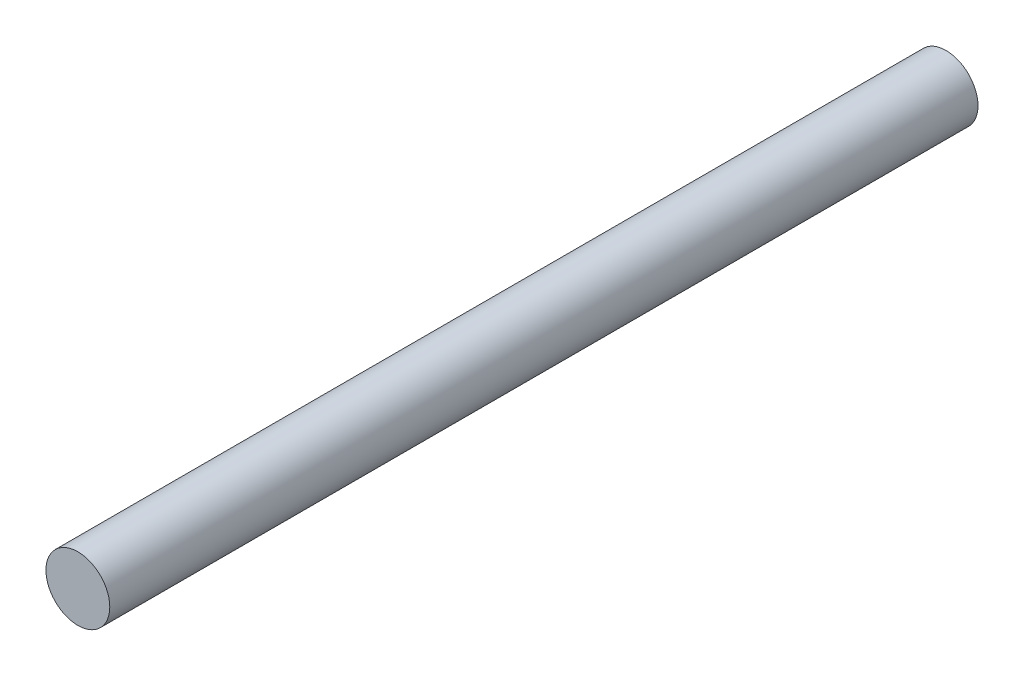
ISO-10303-21;
HEADER;
FILE_DESCRIPTION(('STEP AP214'),'2;1');
FILE_NAME('part.step','',(''),(''),'','','');
FILE_SCHEMA(('AUTOMOTIVE_DESIGN { 1 0 10303 214 1 1 1 1 }'));
ENDSEC;
DATA;
#1=APPLICATION_CONTEXT('core data for automotive mechanical design processes');
#2=APPLICATION_PROTOCOL_DEFINITION('international standard','automotive_design',2000,#1);
#3=PRODUCT_CONTEXT('',#1,'mechanical');
#4=PRODUCT('Part','Part','',(#3));
#5=PRODUCT_RELATED_PRODUCT_CATEGORY('part','',(#4));
#6=PRODUCT_DEFINITION_FORMATION('','',#4);
#7=PRODUCT_DEFINITION_CONTEXT('part definition',#1,'design');
#8=PRODUCT_DEFINITION('design','',#6,#7);
#9=PRODUCT_DEFINITION_SHAPE('','',#8);
#10=(LENGTH_UNIT() NAMED_UNIT(*) SI_UNIT(.MILLI.,.METRE.));
#11=(NAMED_UNIT(*) PLANE_ANGLE_UNIT() SI_UNIT($,.RADIAN.));
#12=(NAMED_UNIT(*) SI_UNIT($,.STERADIAN.) SOLID_ANGLE_UNIT());
#13=UNCERTAINTY_MEASURE_WITH_UNIT(LENGTH_MEASURE(1.E-05),#10,'distance_accuracy_value','');
#14=(GEOMETRIC_REPRESENTATION_CONTEXT(3) GLOBAL_UNCERTAINTY_ASSIGNED_CONTEXT((#13)) GLOBAL_UNIT_ASSIGNED_CONTEXT((#10,
#11,#12)) REPRESENTATION_CONTEXT('',''));
#15=CARTESIAN_POINT('',(0.,0.,0.));
#16=DIRECTION('',(0.,0.,1.));
#17=DIRECTION('',(1.,0.,0.));
#18=AXIS2_PLACEMENT_3D('',#15,#16,#17);
#19=CARTESIAN_POINT('',(0.,0.,68.));
#20=DIRECTION('',(0.,0.,-1.));
#21=DIRECTION('',(-1.,0.,0.));
#22=AXIS2_PLACEMENT_3D('',#19,#20,#21);
#23=CYLINDRICAL_SURFACE('',#22,2.5);
#24=CARTESIAN_POINT('',(0.,0.,68.));
#25=DIRECTION('',(0.,0.,1.));
#26=DIRECTION('',(1.,0.,0.));
#27=AXIS2_PLACEMENT_3D('',#24,#25,#26);
#28=CIRCLE('',#27,2.5);
#29=CARTESIAN_POINT('',(2.5,0.,68.));
#30=VERTEX_POINT('',#29);
#31=EDGE_CURVE('E10',#30,#30,#28,.T.);
#32=ORIENTED_EDGE('',*,*,#31,.F.);
#33=EDGE_LOOP('',(#32));
#34=FACE_BOUND('',#33,.T.);
#35=CARTESIAN_POINT('',(0.,0.,0.));
#36=DIRECTION('',(0.,0.,1.));
#37=DIRECTION('',(1.,0.,0.));
#38=AXIS2_PLACEMENT_3D('',#35,#36,#37);
#39=CIRCLE('',#38,2.5);
#40=CARTESIAN_POINT('',(2.5,0.,0.));
#41=VERTEX_POINT('',#40);
#42=EDGE_CURVE('E37',#41,#41,#39,.T.);
#43=ORIENTED_EDGE('',*,*,#42,.T.);
#44=EDGE_LOOP('',(#43));
#45=FACE_BOUND('',#44,.T.);
#46=ADVANCED_FACE('F40',(#34,#45),#23,.T.);
#47=CARTESIAN_POINT('',(0.,0.,68.));
#48=DIRECTION('',(0.,0.,1.));
#49=DIRECTION('',(1.,0.,0.));
#50=AXIS2_PLACEMENT_3D('',#47,#48,#49);
#51=PLANE('',#50);
#52=ORIENTED_EDGE('',*,*,#31,.T.);
#53=EDGE_LOOP('',(#52));
#54=FACE_BOUND('',#53,.T.);
#55=ADVANCED_FACE('F55',(#54),#51,.T.);
#56=CARTESIAN_POINT('',(0.,0.,0.));
#57=DIRECTION('',(0.,0.,1.));
#58=DIRECTION('',(1.,0.,0.));
#59=AXIS2_PLACEMENT_3D('',#56,#57,#58);
#60=PLANE('',#59);
#61=ORIENTED_EDGE('',*,*,#42,.F.);
#62=EDGE_LOOP('',(#61));
#63=FACE_BOUND('',#62,.T.);
#64=ADVANCED_FACE('F49',(#63),#60,.F.);
#65=CLOSED_SHELL('',(#46,#55,#64));
#66=MANIFOLD_SOLID_BREP('B2',#65);
#67=ADVANCED_BREP_SHAPE_REPRESENTATION('',(#18,#66),#14);
#68=SHAPE_DEFINITION_REPRESENTATION(#9,#67);
ENDSEC;
END-ISO-10303-21;
